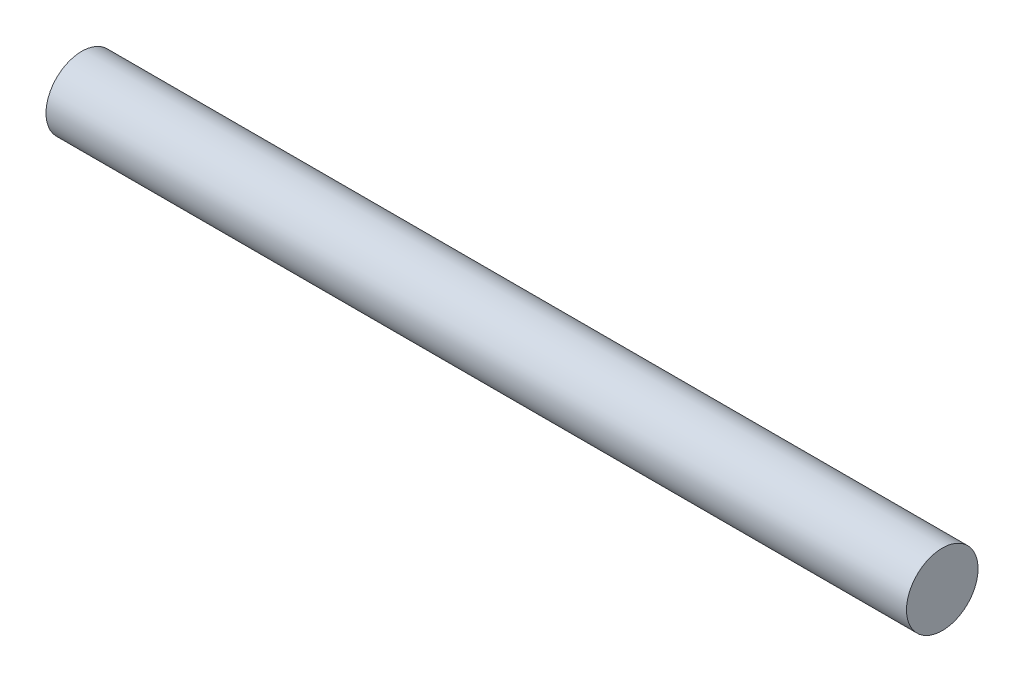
ISO-10303-21;
HEADER;
FILE_DESCRIPTION(('STEP AP214'),'2;1');
FILE_NAME('part.step','',(''),(''),'','','');
FILE_SCHEMA(('AUTOMOTIVE_DESIGN { 1 0 10303 214 1 1 1 1 }'));
ENDSEC;
DATA;
#1=APPLICATION_CONTEXT('core data for automotive mechanical design processes');
#2=APPLICATION_PROTOCOL_DEFINITION('international standard','automotive_design',2000,#1);
#3=PRODUCT_CONTEXT('',#1,'mechanical');
#4=PRODUCT('Part','Part','',(#3));
#5=PRODUCT_RELATED_PRODUCT_CATEGORY('part','',(#4));
#6=PRODUCT_DEFINITION_FORMATION('','',#4);
#7=PRODUCT_DEFINITION_CONTEXT('part definition',#1,'design');
#8=PRODUCT_DEFINITION('design','',#6,#7);
#9=PRODUCT_DEFINITION_SHAPE('','',#8);
#10=(LENGTH_UNIT() NAMED_UNIT(*) SI_UNIT(.MILLI.,.METRE.));
#11=(NAMED_UNIT(*) PLANE_ANGLE_UNIT() SI_UNIT($,.RADIAN.));
#12=(NAMED_UNIT(*) SI_UNIT($,.STERADIAN.) SOLID_ANGLE_UNIT());
#13=UNCERTAINTY_MEASURE_WITH_UNIT(LENGTH_MEASURE(1.E-05),#10,'distance_accuracy_value','');
#14=(GEOMETRIC_REPRESENTATION_CONTEXT(3) GLOBAL_UNCERTAINTY_ASSIGNED_CONTEXT((#13)) GLOBAL_UNIT_ASSIGNED_CONTEXT((#10,
#11,#12)) REPRESENTATION_CONTEXT('',''));
#15=CARTESIAN_POINT('',(0.,0.,0.));
#16=DIRECTION('',(0.,0.,1.));
#17=DIRECTION('',(1.,0.,0.));
#18=AXIS2_PLACEMENT_3D('',#15,#16,#17);
#19=CARTESIAN_POINT('',(0.,0.,0.));
#20=DIRECTION('',(1.,0.,0.));
#21=DIRECTION('',(0.,0.,-1.));
#22=AXIS2_PLACEMENT_3D('',#19,#20,#21);
#23=PLANE('',#22);
#24=CARTESIAN_POINT('',(0.,0.,0.));
#25=DIRECTION('',(-1.,0.,0.));
#26=DIRECTION('',(0.,0.,1.));
#27=AXIS2_PLACEMENT_3D('',#24,#25,#26);
#28=CIRCLE('',#27,3.2004);
#29=CARTESIAN_POINT('',(0.,0.,3.2004));
#30=VERTEX_POINT('',#29);
#31=EDGE_CURVE('E10',#30,#30,#28,.T.);
#32=ORIENTED_EDGE('',*,*,#31,.T.);
#33=EDGE_LOOP('',(#32));
#34=FACE_BOUND('',#33,.T.);
#35=ADVANCED_FACE('F31',(#34),#23,.F.);
#36=CARTESIAN_POINT('',(76.962,0.,0.));
#37=DIRECTION('',(-1.,0.,0.));
#38=DIRECTION('',(0.,0.,1.));
#39=AXIS2_PLACEMENT_3D('',#36,#37,#38);
#40=CYLINDRICAL_SURFACE('',#39,3.2004);
#41=ORIENTED_EDGE('',*,*,#31,.F.);
#42=EDGE_LOOP('',(#41));
#43=FACE_BOUND('',#42,.T.);
#44=CARTESIAN_POINT('',(76.962,0.,0.));
#45=DIRECTION('',(-1.,0.,0.));
#46=DIRECTION('',(0.,0.,1.));
#47=AXIS2_PLACEMENT_3D('',#44,#45,#46);
#48=CIRCLE('',#47,3.2004);
#49=CARTESIAN_POINT('',(76.962,0.,3.2004));
#50=VERTEX_POINT('',#49);
#51=EDGE_CURVE('E37',#50,#50,#48,.T.);
#52=ORIENTED_EDGE('',*,*,#51,.T.);
#53=EDGE_LOOP('',(#52));
#54=FACE_BOUND('',#53,.T.);
#55=ADVANCED_FACE('F43',(#43,#54),#40,.T.);
#56=CARTESIAN_POINT('',(76.962,3.2004,0.));
#57=DIRECTION('',(-1.,0.,0.));
#58=DIRECTION('',(0.,0.,1.));
#59=AXIS2_PLACEMENT_3D('',#56,#57,#58);
#60=PLANE('',#59);
#61=ORIENTED_EDGE('',*,*,#51,.F.);
#62=EDGE_LOOP('',(#61));
#63=FACE_BOUND('',#62,.T.);
#64=ADVANCED_FACE('F45',(#63),#60,.F.);
#65=CLOSED_SHELL('',(#35,#55,#64));
#66=MANIFOLD_SOLID_BREP('B2',#65);
#67=ADVANCED_BREP_SHAPE_REPRESENTATION('',(#18,#66),#14);
#68=SHAPE_DEFINITION_REPRESENTATION(#9,#67);
ENDSEC;
END-ISO-10303-21;
